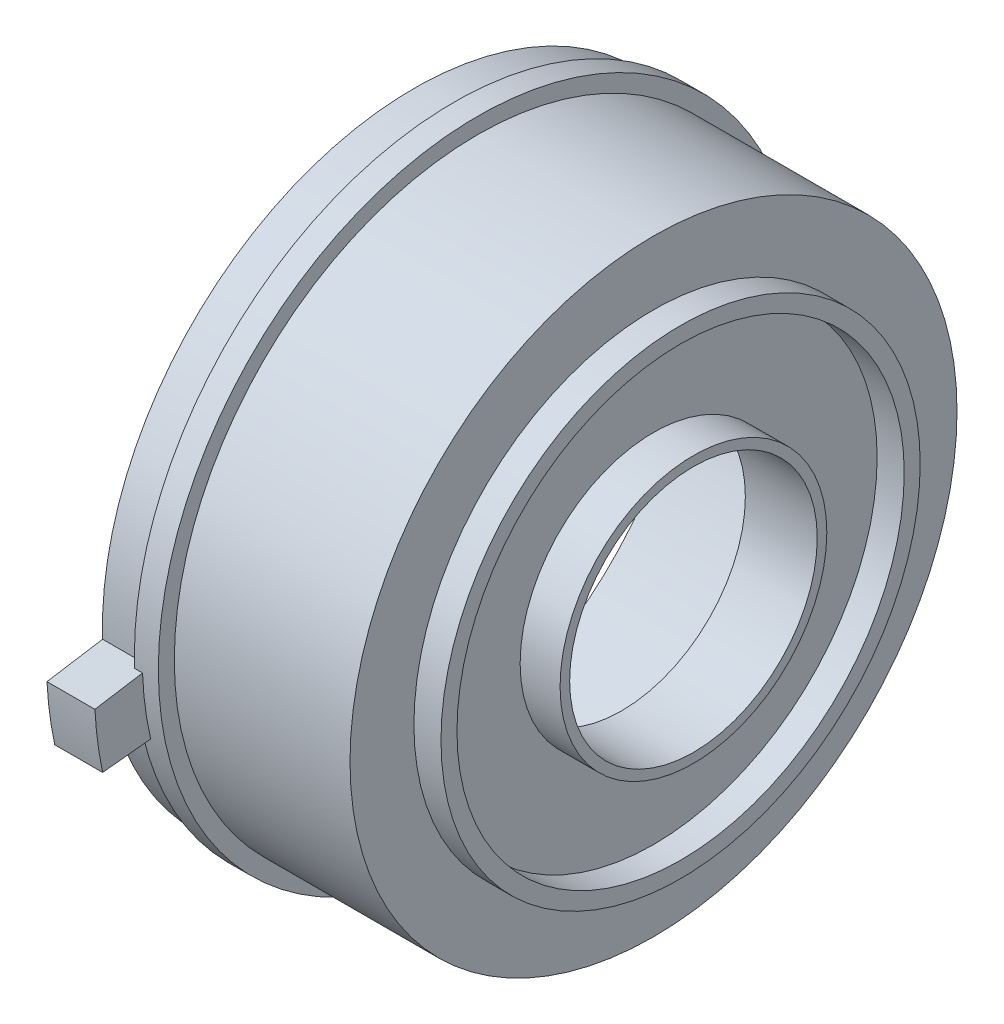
from build123d import *

# Parameters (mm, degrees)
BOSS_EXTRU_1_START = -3
BOSS_EXTRU_1_DEPTH = 3


with BuildPart() as part:
    # Esquisse1 → Base-R_volution (revolve)
    with BuildSketch(Plane.XY, mode=Mode.PRIVATE) as base_r_volution_sk:
        Polygon((101, 20), (101, 19), (112, 19), (112, 15), (113.69517882, 15), (113.69517882, 14), (112, 14), (112, 8.35), (114.5, 8.35), (114.5, 7.75), (110, 7.75), (110, 17.5), (97, 17.5), (97, 19.5), (99.5, 19.5), (99.5, 20), align=None)
    revolve(base_r_volution_sk.sketch.rotate(Axis((0, 0, 0), (1, 0, 0)), 90), axis=Axis((0, 0, 0), (1, 0, 0)))

    # Esquisse2 → Boss.-Extru.1 (add)
    with BuildSketch(Plane.ZY.offset(-97).offset(BOSS_EXTRU_1_START)):
        with BuildLine():
            Line((22.969855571, -1.177172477), (18.992397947, -0.537419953))
            ThreePointArc((18.992397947, -0.537419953), (18.835397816, -2.495553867), (18.477055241, -4.427011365))
            Line((18.477055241, -4.427011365), (22.483879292, -4.845118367))
            ThreePointArc((22.483879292, -4.845118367), (22.800744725, -3.020933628), (22.969855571, -1.177172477))
        make_face()
    extrude(amount=BOSS_EXTRU_1_DEPTH)


solid = part.part
